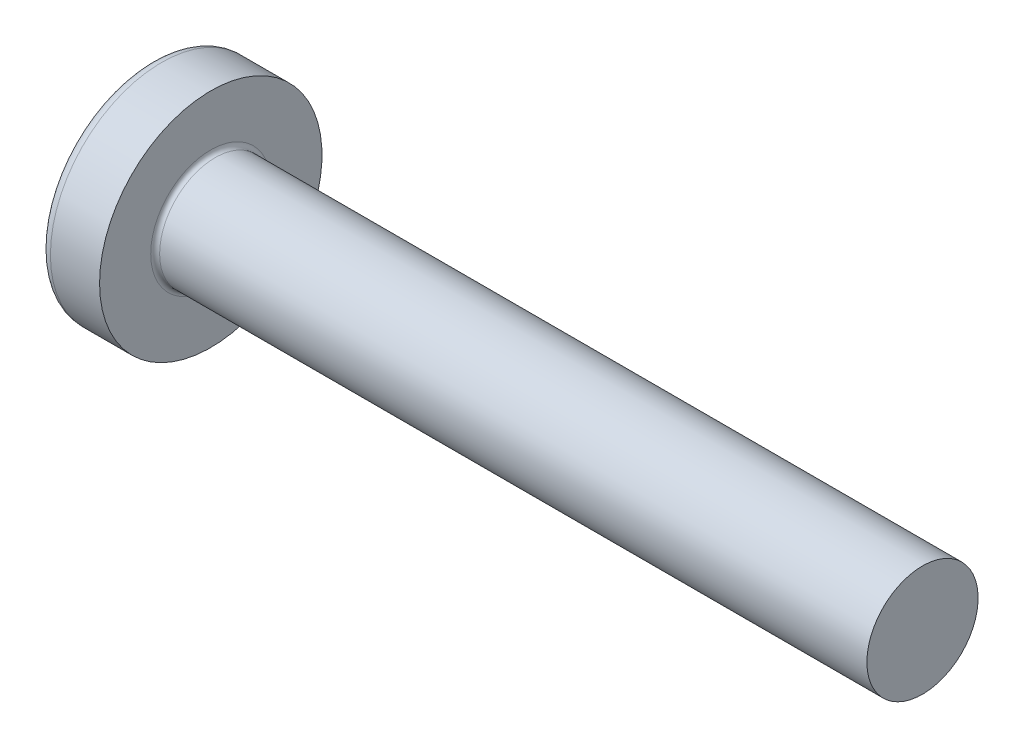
ISO-10303-21;
HEADER;
FILE_DESCRIPTION(('STEP AP214'),'2;1');
FILE_NAME('part.step','',(''),(''),'','','');
FILE_SCHEMA(('AUTOMOTIVE_DESIGN { 1 0 10303 214 1 1 1 1 }'));
ENDSEC;
DATA;
#1=APPLICATION_CONTEXT('core data for automotive mechanical design processes');
#2=APPLICATION_PROTOCOL_DEFINITION('international standard','automotive_design',2000,#1);
#3=PRODUCT_CONTEXT('',#1,'mechanical');
#4=PRODUCT('Part','Part','',(#3));
#5=PRODUCT_RELATED_PRODUCT_CATEGORY('part','',(#4));
#6=PRODUCT_DEFINITION_FORMATION('','',#4);
#7=PRODUCT_DEFINITION_CONTEXT('part definition',#1,'design');
#8=PRODUCT_DEFINITION('design','',#6,#7);
#9=PRODUCT_DEFINITION_SHAPE('','',#8);
#10=(LENGTH_UNIT() NAMED_UNIT(*) SI_UNIT(.MILLI.,.METRE.));
#11=(NAMED_UNIT(*) PLANE_ANGLE_UNIT() SI_UNIT($,.RADIAN.));
#12=(NAMED_UNIT(*) SI_UNIT($,.STERADIAN.) SOLID_ANGLE_UNIT());
#13=UNCERTAINTY_MEASURE_WITH_UNIT(LENGTH_MEASURE(1.E-05),#10,'distance_accuracy_value','');
#14=(GEOMETRIC_REPRESENTATION_CONTEXT(3) GLOBAL_UNCERTAINTY_ASSIGNED_CONTEXT((#13)) GLOBAL_UNIT_ASSIGNED_CONTEXT((#10,
#11,#12)) REPRESENTATION_CONTEXT('',''));
#15=CARTESIAN_POINT('',(0.,0.,0.));
#16=DIRECTION('',(0.,0.,1.));
#17=DIRECTION('',(1.,0.,0.));
#18=AXIS2_PLACEMENT_3D('',#15,#16,#17);
#19=CARTESIAN_POINT('',(4.,0.,0.));
#20=DIRECTION('',(-1.,0.,0.));
#21=DIRECTION('',(0.,1.,0.));
#22=AXIS2_PLACEMENT_3D('',#19,#20,#21);
#23=SPHERICAL_SURFACE('',#22,4.);
#24=CARTESIAN_POINT('',(0.803195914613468,0.,0.));
#25=DIRECTION('',(-1.,0.,0.));
#26=DIRECTION('',(0.,0.,1.));
#27=AXIS2_PLACEMENT_3D('',#24,#25,#26);
#28=CIRCLE('',#27,2.40425531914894);
#29=CARTESIAN_POINT('',(0.803195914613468,0.,2.40425531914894));
#30=VERTEX_POINT('',#29);
#31=EDGE_CURVE('E240',#30,#30,#28,.T.);
#32=ORIENTED_EDGE('',*,*,#31,.T.);
#33=EDGE_LOOP('',(#32));
#34=FACE_BOUND('',#33,.T.);
#35=CARTESIAN_POINT('',(0.0543400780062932,0.,0.));
#36=DIRECTION('',(1.,0.,0.));
#37=DIRECTION('',(0.,0.,-1.));
#38=AXIS2_PLACEMENT_3D('',#35,#36,#37);
#39=CIRCLE('',#38,0.657090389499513);
#40=CARTESIAN_POINT('',(0.0543400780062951,-0.369999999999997,-0.543017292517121));
#41=VERTEX_POINT('',#40);
#42=CARTESIAN_POINT('',(0.0543400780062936,-0.543017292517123,-0.37));
#43=VERTEX_POINT('',#42);
#44=EDGE_CURVE('E376',#41,#43,#39,.F.);
#45=ORIENTED_EDGE('',*,*,#44,.F.);
#46=CARTESIAN_POINT('',(4.,-0.370000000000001,0.));
#47=DIRECTION('',(0.,1.,0.));
#48=DIRECTION('',(0.,0.,1.));
#49=AXIS2_PLACEMENT_3D('',#46,#47,#48);
#50=CIRCLE('',#49,3.98285073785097);
#51=CARTESIAN_POINT('',(0.201999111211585,-0.369999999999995,-1.19928697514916));
#52=VERTEX_POINT('',#51);
#53=EDGE_CURVE('E302',#52,#41,#50,.T.);
#54=ORIENTED_EDGE('',*,*,#53,.F.);
#55=CARTESIAN_POINT('',(3.72274328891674,0.,0.556091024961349));
#56=DIRECTION('',(0.446197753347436,0.,-0.894934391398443));
#57=DIRECTION('',(-0.894934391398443,0.,-0.446197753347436));
#58=AXIS2_PLACEMENT_3D('',#55,#56,#57);
#59=CIRCLE('',#58,3.95144169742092);
#60=CARTESIAN_POINT('',(0.201999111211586,0.370000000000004,-1.19928697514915));
#61=VERTEX_POINT('',#60);
#62=EDGE_CURVE('E274',#52,#61,#59,.T.);
#63=ORIENTED_EDGE('',*,*,#62,.T.);
#64=CARTESIAN_POINT('',(4.,0.369999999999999,0.));
#65=DIRECTION('',(0.,-1.,0.));
#66=DIRECTION('',(0.,0.,-1.));
#67=AXIS2_PLACEMENT_3D('',#64,#65,#66);
#68=CIRCLE('',#67,3.98285073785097);
#69=CARTESIAN_POINT('',(0.0543400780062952,0.370000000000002,-0.543017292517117));
#70=VERTEX_POINT('',#69);
#71=EDGE_CURVE('E329',#70,#61,#68,.T.);
#72=ORIENTED_EDGE('',*,*,#71,.F.);
#73=CARTESIAN_POINT('',(0.0543400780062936,0.543017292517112,-0.37));
#74=VERTEX_POINT('',#73);
#75=EDGE_CURVE('E395',#74,#70,#39,.F.);
#76=ORIENTED_EDGE('',*,*,#75,.F.);
#77=CARTESIAN_POINT('',(4.,0.,-0.369999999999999));
#78=DIRECTION('',(0.,0.,1.));
#79=DIRECTION('',(1.,0.,0.));
#80=AXIS2_PLACEMENT_3D('',#77,#78,#79);
#81=CIRCLE('',#80,3.98285073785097);
#82=CARTESIAN_POINT('',(0.201999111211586,1.19928697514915,-0.37));
#83=VERTEX_POINT('',#82);
#84=EDGE_CURVE('E268',#83,#74,#81,.T.);
#85=ORIENTED_EDGE('',*,*,#84,.F.);
#86=CARTESIAN_POINT('',(3.72274328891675,-0.55609102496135,0.));
#87=DIRECTION('',(0.446197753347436,0.894934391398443,0.));
#88=DIRECTION('',(-0.894934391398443,0.446197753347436,0.));
#89=AXIS2_PLACEMENT_3D('',#86,#87,#88);
#90=CIRCLE('',#89,3.95144169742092);
#91=CARTESIAN_POINT('',(0.201999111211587,1.19928697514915,0.37));
#92=VERTEX_POINT('',#91);
#93=EDGE_CURVE('E271',#83,#92,#90,.T.);
#94=ORIENTED_EDGE('',*,*,#93,.T.);
#95=CARTESIAN_POINT('',(4.,0.,0.370000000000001));
#96=DIRECTION('',(0.,0.,-1.));
#97=DIRECTION('',(-1.,0.,0.));
#98=AXIS2_PLACEMENT_3D('',#95,#96,#97);
#99=CIRCLE('',#98,3.98285073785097);
#100=CARTESIAN_POINT('',(0.0543400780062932,0.543017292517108,0.369999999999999));
#101=VERTEX_POINT('',#100);
#102=EDGE_CURVE('E264',#101,#92,#99,.T.);
#103=ORIENTED_EDGE('',*,*,#102,.F.);
#104=CARTESIAN_POINT('',(0.0543400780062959,0.369999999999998,0.54301729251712));
#105=VERTEX_POINT('',#104);
#106=EDGE_CURVE('E433',#105,#101,#39,.F.);
#107=ORIENTED_EDGE('',*,*,#106,.F.);
#108=CARTESIAN_POINT('',(0.201999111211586,0.369999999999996,1.19928697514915));
#109=VERTEX_POINT('',#108);
#110=EDGE_CURVE('E284',#109,#105,#68,.T.);
#111=ORIENTED_EDGE('',*,*,#110,.F.);
#112=CARTESIAN_POINT('',(3.72274328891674,0.,-0.556091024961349));
#113=DIRECTION('',(0.446197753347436,0.,0.894934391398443));
#114=DIRECTION('',(0.894934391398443,0.,-0.446197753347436));
#115=AXIS2_PLACEMENT_3D('',#112,#113,#114);
#116=CIRCLE('',#115,3.95144169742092);
#117=CARTESIAN_POINT('',(0.201999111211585,-0.370000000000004,1.19928697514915));
#118=VERTEX_POINT('',#117);
#119=EDGE_CURVE('E51',#109,#118,#116,.T.);
#120=ORIENTED_EDGE('',*,*,#119,.T.);
#121=CARTESIAN_POINT('',(0.0543400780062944,-0.370000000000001,0.543017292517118));
#122=VERTEX_POINT('',#121);
#123=EDGE_CURVE('E281',#122,#118,#50,.T.);
#124=ORIENTED_EDGE('',*,*,#123,.F.);
#125=CARTESIAN_POINT('',(0.0543400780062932,-0.543017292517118,0.369999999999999));
#126=VERTEX_POINT('',#125);
#127=EDGE_CURVE('E394',#126,#122,#39,.F.);
#128=ORIENTED_EDGE('',*,*,#127,.F.);
#129=CARTESIAN_POINT('',(0.201999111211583,-1.19928697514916,0.369999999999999));
#130=VERTEX_POINT('',#129);
#131=EDGE_CURVE('E265',#130,#126,#99,.T.);
#132=ORIENTED_EDGE('',*,*,#131,.F.);
#133=CARTESIAN_POINT('',(3.72274328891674,0.556091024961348,0.));
#134=DIRECTION('',(0.446197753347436,-0.894934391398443,0.));
#135=DIRECTION('',(0.894934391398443,0.446197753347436,0.));
#136=AXIS2_PLACEMENT_3D('',#133,#134,#135);
#137=CIRCLE('',#136,3.95144169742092);
#138=CARTESIAN_POINT('',(0.201999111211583,-1.19928697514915,-0.37));
#139=VERTEX_POINT('',#138);
#140=EDGE_CURVE('E261',#130,#139,#137,.T.);
#141=ORIENTED_EDGE('',*,*,#140,.T.);
#142=EDGE_CURVE('E66',#43,#139,#81,.T.);
#143=ORIENTED_EDGE('',*,*,#142,.F.);
#144=EDGE_LOOP('',(#45,#54,#63,#72,#76,#85,#94,#103,#107,#111,#120,#124,#128,#132,#141,#143));
#145=FACE_BOUND('',#144,.T.);
#146=ADVANCED_FACE('F37',(#34,#145),#23,.T.);
#147=CARTESIAN_POINT('',(1.5,0.552127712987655,-0.37));
#148=DIRECTION('',(0.,0.,1.));
#149=DIRECTION('',(1.,0.,0.));
#150=AXIS2_PLACEMENT_3D('',#147,#148,#149);
#151=PLANE('',#150);
#152=ORIENTED_EDGE('',*,*,#84,.T.);
#153=CARTESIAN_POINT('',(-0.984107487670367,0.628943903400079,-0.37));
#154=CARTESIAN_POINT('',(-0.783603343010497,0.61266994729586,-0.37));
#155=CARTESIAN_POINT('',(-0.583110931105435,0.596248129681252,-0.37));
#156=CARTESIAN_POINT('',(-0.182155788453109,0.562989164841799,-0.37));
#157=CARTESIAN_POINT('',(0.0183069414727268,0.546152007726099,-0.37));
#158=CARTESIAN_POINT('',(0.419186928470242,0.511943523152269,-0.37));
#159=CARTESIAN_POINT('',(0.619604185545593,0.494572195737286,-0.37));
#160=CARTESIAN_POINT('',(1.02037173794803,0.459102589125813,-0.37));
#161=CARTESIAN_POINT('',(1.2207220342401,0.441004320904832,-0.37));
#162=CARTESIAN_POINT('',(1.53631168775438,0.411665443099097,-0.37));
#163=CARTESIAN_POINT('',(1.65158348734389,0.400774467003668,-0.37));
#164=CARTESIAN_POINT('',(1.88208360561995,0.378547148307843,-0.37));
#165=CARTESIAN_POINT('',(1.99731192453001,0.367210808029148,-0.37));
#166=CARTESIAN_POINT('',(2.22771614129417,0.343963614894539,-0.37));
#167=CARTESIAN_POINT('',(2.34289203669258,0.332052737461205,-0.37));
#168=CARTESIAN_POINT('',(2.57315819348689,0.307413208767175,-0.37));
#169=CARTESIAN_POINT('',(2.68824845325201,0.294684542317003,-0.37));
#170=CARTESIAN_POINT('',(2.80327961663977,0.281425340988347,-0.37));
#171=B_SPLINE_CURVE_WITH_KNOTS('',3,(#153,#154,#155,#156,#157,#158,#159,#160,#161,#162,#163,
#164,#165,#166,#167,#168,#169,#170),.UNSPECIFIED.,.F.,.F.,(4,2,2,2,2,2,2,2,4),(0.,
0.603490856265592,1.20699609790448,1.81050129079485,2.41399737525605,2.76135214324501,
3.1087051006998,3.45607293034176,3.80344721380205),.UNSPECIFIED.);
#172=CARTESIAN_POINT('',(1.5,0.415013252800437,-0.370000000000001));
#173=VERTEX_POINT('',#172);
#174=EDGE_CURVE('E418',#74,#173,#171,.T.);
#175=ORIENTED_EDGE('',*,*,#174,.T.);
#176=DIRECTION('',(0.,1.,0.));
#177=VECTOR('',#176,1.);
#178=CARTESIAN_POINT('',(1.5,-0.552127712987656,-0.37));
#179=LINE('',#178,#177);
#180=CARTESIAN_POINT('',(1.5,0.552127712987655,-0.37));
#181=VERTEX_POINT('',#180);
#182=EDGE_CURVE('E358',#173,#181,#179,.T.);
#183=ORIENTED_EDGE('',*,*,#182,.T.);
#184=DIRECTION('',(0.894934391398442,-0.446197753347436,0.));
#185=VECTOR('',#184,1.);
#186=CARTESIAN_POINT('',(0.,1.3,-0.37));
#187=LINE('',#186,#185);
#188=EDGE_CURVE('E241',#83,#181,#187,.T.);
#189=ORIENTED_EDGE('',*,*,#188,.F.);
#190=EDGE_LOOP('',(#152,#175,#183,#189));
#191=FACE_BOUND('',#190,.T.);
#192=ADVANCED_FACE('F196',(#191),#151,.T.);
#193=CARTESIAN_POINT('',(1.5,-0.552127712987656,-0.37));
#194=VERTEX_POINT('',#193);
#195=CARTESIAN_POINT('',(1.5,-0.415013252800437,-0.370000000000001));
#196=VERTEX_POINT('',#195);
#197=EDGE_CURVE('E249',#194,#196,#179,.T.);
#198=ORIENTED_EDGE('',*,*,#197,.T.);
#199=CARTESIAN_POINT('',(-0.984107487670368,-0.628943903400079,-0.37));
#200=CARTESIAN_POINT('',(-0.783603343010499,-0.61266994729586,-0.37));
#201=CARTESIAN_POINT('',(-0.583110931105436,-0.596248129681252,-0.37));
#202=CARTESIAN_POINT('',(-0.18215578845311,-0.562989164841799,-0.37));
#203=CARTESIAN_POINT('',(0.0183069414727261,-0.546152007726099,-0.37));
#204=CARTESIAN_POINT('',(0.419186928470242,-0.511943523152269,-0.37));
#205=CARTESIAN_POINT('',(0.619604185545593,-0.494572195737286,-0.37));
#206=CARTESIAN_POINT('',(1.02037173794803,-0.459102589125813,-0.37));
#207=CARTESIAN_POINT('',(1.22072203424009,-0.441004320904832,-0.37));
#208=CARTESIAN_POINT('',(1.53631168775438,-0.411665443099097,-0.37));
#209=CARTESIAN_POINT('',(1.65158348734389,-0.400774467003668,-0.37));
#210=CARTESIAN_POINT('',(1.88208360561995,-0.378547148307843,-0.37));
#211=CARTESIAN_POINT('',(1.99731192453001,-0.367210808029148,-0.37));
#212=CARTESIAN_POINT('',(2.22771614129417,-0.343963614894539,-0.37));
#213=CARTESIAN_POINT('',(2.34289203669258,-0.332052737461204,-0.37));
#214=CARTESIAN_POINT('',(2.57315819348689,-0.307413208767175,-0.37));
#215=CARTESIAN_POINT('',(2.68824845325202,-0.294684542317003,-0.37));
#216=CARTESIAN_POINT('',(2.80327961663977,-0.281425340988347,-0.37));
#217=B_SPLINE_CURVE_WITH_KNOTS('',3,(#199,#200,#201,#202,#203,#204,#205,#206,#207,#208,#209,
#210,#211,#212,#213,#214,#215,#216),.UNSPECIFIED.,.F.,.F.,(4,2,2,2,2,2,2,2,4),(0.,
0.603490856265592,1.20699609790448,1.81050129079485,2.41399737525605,2.76135214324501,
3.1087051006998,3.45607293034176,3.80344721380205),.UNSPECIFIED.);
#218=EDGE_CURVE('E393',#196,#43,#217,.F.);
#219=ORIENTED_EDGE('',*,*,#218,.T.);
#220=ORIENTED_EDGE('',*,*,#142,.T.);
#221=DIRECTION('',(0.894934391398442,0.446197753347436,0.));
#222=VECTOR('',#221,1.);
#223=CARTESIAN_POINT('',(0.,-1.3,-0.37));
#224=LINE('',#223,#222);
#225=EDGE_CURVE('E332',#139,#194,#224,.T.);
#226=ORIENTED_EDGE('',*,*,#225,.T.);
#227=EDGE_LOOP('',(#198,#219,#220,#226));
#228=FACE_BOUND('',#227,.T.);
#229=ADVANCED_FACE('F202',(#228),#151,.T.);
#230=CARTESIAN_POINT('',(1.5,-0.552127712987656,0.37));
#231=DIRECTION('',(0.,0.,-1.));
#232=DIRECTION('',(-1.,0.,0.));
#233=AXIS2_PLACEMENT_3D('',#230,#231,#232);
#234=PLANE('',#233);
#235=DIRECTION('',(0.,-1.,0.));
#236=VECTOR('',#235,1.);
#237=CARTESIAN_POINT('',(1.5,0.552127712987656,0.37));
#238=LINE('',#237,#236);
#239=CARTESIAN_POINT('',(1.5,0.552127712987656,0.37));
#240=VERTEX_POINT('',#239);
#241=CARTESIAN_POINT('',(1.5,0.415013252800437,0.370000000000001));
#242=VERTEX_POINT('',#241);
#243=EDGE_CURVE('E341',#240,#242,#238,.T.);
#244=ORIENTED_EDGE('',*,*,#243,.T.);
#245=CARTESIAN_POINT('',(-0.984107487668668,0.628943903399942,0.369999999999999));
#246=CARTESIAN_POINT('',(-0.783603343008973,0.612669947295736,0.369999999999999));
#247=CARTESIAN_POINT('',(-0.583110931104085,0.596248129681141,0.369999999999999));
#248=CARTESIAN_POINT('',(-0.182155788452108,0.562989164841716,0.369999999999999));
#249=CARTESIAN_POINT('',(0.018306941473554,0.54615200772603,0.369999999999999));
#250=CARTESIAN_POINT('',(0.419186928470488,0.511943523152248,0.369999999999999));
#251=CARTESIAN_POINT('',(0.619604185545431,0.4945721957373,0.369999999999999));
#252=CARTESIAN_POINT('',(1.02037173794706,0.459102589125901,0.37));
#253=CARTESIAN_POINT('',(1.22072203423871,0.441004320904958,0.37));
#254=CARTESIAN_POINT('',(1.53631168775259,0.411665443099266,0.37));
#255=CARTESIAN_POINT('',(1.65158348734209,0.400774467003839,0.37));
#256=CARTESIAN_POINT('',(1.88208360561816,0.378547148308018,0.37));
#257=CARTESIAN_POINT('',(1.99731192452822,0.367210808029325,0.37));
#258=CARTESIAN_POINT('',(2.22771614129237,0.343963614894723,0.37));
#259=CARTESIAN_POINT('',(2.34289203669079,0.332052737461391,0.37));
#260=CARTESIAN_POINT('',(2.5731581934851,0.30741320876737,0.370000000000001));
#261=CARTESIAN_POINT('',(2.68824845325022,0.294684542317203,0.370000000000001));
#262=CARTESIAN_POINT('',(2.80327961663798,0.281425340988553,0.370000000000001));
#263=B_SPLINE_CURVE_WITH_KNOTS('',3,(#245,#246,#247,#248,#249,#250,#251,#252,#253,#254,#255,
#256,#257,#258,#259,#260,#261,#262),.UNSPECIFIED.,.F.,.F.,(4,2,2,2,2,2,2,2,4),(0.,
0.603490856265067,1.20699609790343,1.81050129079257,2.41399737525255,2.7613521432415,
3.1087051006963,3.45607293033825,3.80344721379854),.UNSPECIFIED.);
#264=EDGE_CURVE('E434',#242,#101,#263,.F.);
#265=ORIENTED_EDGE('',*,*,#264,.T.);
#266=ORIENTED_EDGE('',*,*,#102,.T.);
#267=DIRECTION('',(0.894934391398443,-0.446197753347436,0.));
#268=VECTOR('',#267,1.);
#269=CARTESIAN_POINT('',(0.,1.3,0.37));
#270=LINE('',#269,#268);
#271=EDGE_CURVE('E246',#92,#240,#270,.T.);
#272=ORIENTED_EDGE('',*,*,#271,.T.);
#273=EDGE_LOOP('',(#244,#265,#266,#272));
#274=FACE_BOUND('',#273,.T.);
#275=ADVANCED_FACE('F414',(#274),#234,.T.);
#276=ORIENTED_EDGE('',*,*,#131,.T.);
#277=CARTESIAN_POINT('',(-0.984107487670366,-0.62894390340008,0.369999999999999));
#278=CARTESIAN_POINT('',(-0.783603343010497,-0.612669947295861,0.369999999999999));
#279=CARTESIAN_POINT('',(-0.583110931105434,-0.596248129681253,0.369999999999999));
#280=CARTESIAN_POINT('',(-0.182155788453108,-0.5629891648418,0.369999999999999));
#281=CARTESIAN_POINT('',(0.0183069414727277,-0.5461520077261,0.369999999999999));
#282=CARTESIAN_POINT('',(0.419186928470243,-0.511943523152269,0.369999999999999));
#283=CARTESIAN_POINT('',(0.619604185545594,-0.494572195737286,0.369999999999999));
#284=CARTESIAN_POINT('',(1.02037173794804,-0.459102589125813,0.37));
#285=CARTESIAN_POINT('',(1.2207220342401,-0.441004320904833,0.37));
#286=CARTESIAN_POINT('',(1.53631168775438,-0.411665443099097,0.37));
#287=CARTESIAN_POINT('',(1.65158348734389,-0.400774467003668,0.37));
#288=CARTESIAN_POINT('',(1.88208360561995,-0.378547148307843,0.37));
#289=CARTESIAN_POINT('',(1.99731192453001,-0.367210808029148,0.37));
#290=CARTESIAN_POINT('',(2.22771614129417,-0.343963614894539,0.37));
#291=CARTESIAN_POINT('',(2.34289203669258,-0.332052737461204,0.37));
#292=CARTESIAN_POINT('',(2.57315819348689,-0.307413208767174,0.37));
#293=CARTESIAN_POINT('',(2.68824845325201,-0.294684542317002,0.370000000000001));
#294=CARTESIAN_POINT('',(2.80327961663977,-0.281425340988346,0.370000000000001));
#295=B_SPLINE_CURVE_WITH_KNOTS('',3,(#277,#278,#279,#280,#281,#282,#283,#284,#285,#286,#287,
#288,#289,#290,#291,#292,#293,#294),.UNSPECIFIED.,.F.,.F.,(4,2,2,2,2,2,2,2,4),(0.,
0.603490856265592,1.20699609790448,1.81050129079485,2.41399737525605,2.76135214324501,
3.1087051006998,3.45607293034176,3.80344721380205),.UNSPECIFIED.);
#296=CARTESIAN_POINT('',(1.5,-0.415013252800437,0.370000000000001));
#297=VERTEX_POINT('',#296);
#298=EDGE_CURVE('E455',#126,#297,#295,.T.);
#299=ORIENTED_EDGE('',*,*,#298,.T.);
#300=CARTESIAN_POINT('',(1.5,-0.552127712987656,0.37));
#301=VERTEX_POINT('',#300);
#302=EDGE_CURVE('E343',#297,#301,#238,.T.);
#303=ORIENTED_EDGE('',*,*,#302,.T.);
#304=DIRECTION('',(0.894934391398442,0.446197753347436,0.));
#305=VECTOR('',#304,1.);
#306=CARTESIAN_POINT('',(0.,-1.3,0.369999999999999));
#307=LINE('',#306,#305);
#308=EDGE_CURVE('E334',#130,#301,#307,.T.);
#309=ORIENTED_EDGE('',*,*,#308,.F.);
#310=EDGE_LOOP('',(#276,#299,#303,#309));
#311=FACE_BOUND('',#310,.T.);
#312=ADVANCED_FACE('F517',(#311),#234,.T.);
#313=CARTESIAN_POINT('',(1.5,0.552127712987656,0.37));
#314=DIRECTION('',(0.446197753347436,0.894934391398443,0.));
#315=DIRECTION('',(-0.894934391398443,0.446197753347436,0.));
#316=AXIS2_PLACEMENT_3D('',#313,#314,#315);
#317=PLANE('',#316);
#318=CARTESIAN_POINT('',(2.47007552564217,0.068465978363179,0.));
#319=DIRECTION('',(0.446197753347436,0.894934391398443,0.));
#320=DIRECTION('',(-0.894934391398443,0.446197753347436,0.));
#321=AXIS2_PLACEMENT_3D('',#318,#319,#320);
#322=ELLIPSE('',#321,1.0940568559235,0.483340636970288);
#323=CARTESIAN_POINT('',(1.5,0.552127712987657,0.065505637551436));
#324=VERTEX_POINT('',#323);
#325=CARTESIAN_POINT('',(1.5,0.552127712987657,-0.0655056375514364));
#326=VERTEX_POINT('',#325);
#327=EDGE_CURVE('E307',#324,#326,#322,.F.);
#328=ORIENTED_EDGE('',*,*,#327,.F.);
#329=DIRECTION('',(0.,0.,-1.));
#330=VECTOR('',#329,1.);
#331=CARTESIAN_POINT('',(1.5,0.552127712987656,0.37));
#332=LINE('',#331,#330);
#333=EDGE_CURVE('E344',#240,#324,#332,.T.);
#334=ORIENTED_EDGE('',*,*,#333,.F.);
#335=ORIENTED_EDGE('',*,*,#271,.F.);
#336=ORIENTED_EDGE('',*,*,#93,.F.);
#337=ORIENTED_EDGE('',*,*,#188,.T.);
#338=EDGE_CURVE('E346',#326,#181,#332,.T.);
#339=ORIENTED_EDGE('',*,*,#338,.F.);
#340=EDGE_LOOP('',(#328,#334,#335,#336,#337,#339));
#341=FACE_BOUND('',#340,.T.);
#342=ADVANCED_FACE('F412',(#341),#317,.F.);
#343=CARTESIAN_POINT('',(1.5,-0.552127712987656,-0.37));
#344=DIRECTION('',(0.446197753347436,-0.894934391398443,0.));
#345=DIRECTION('',(0.894934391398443,0.446197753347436,0.));
#346=AXIS2_PLACEMENT_3D('',#343,#344,#345);
#347=PLANE('',#346);
#348=CARTESIAN_POINT('',(2.47007552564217,-0.0684659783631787,0.));
#349=DIRECTION('',(0.446197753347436,-0.894934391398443,0.));
#350=DIRECTION('',(-0.894934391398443,-0.446197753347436,0.));
#351=AXIS2_PLACEMENT_3D('',#348,#349,#350);
#352=ELLIPSE('',#351,1.0940568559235,0.483340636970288);
#353=CARTESIAN_POINT('',(1.5,-0.552127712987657,-0.0655056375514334));
#354=VERTEX_POINT('',#353);
#355=CARTESIAN_POINT('',(1.5,-0.552127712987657,0.0655056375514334));
#356=VERTEX_POINT('',#355);
#357=EDGE_CURVE('E461',#354,#356,#352,.F.);
#358=ORIENTED_EDGE('',*,*,#357,.F.);
#359=DIRECTION('',(0.,0.,1.));
#360=VECTOR('',#359,1.);
#361=CARTESIAN_POINT('',(1.5,-0.552127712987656,-0.37));
#362=LINE('',#361,#360);
#363=EDGE_CURVE('E337',#194,#354,#362,.T.);
#364=ORIENTED_EDGE('',*,*,#363,.F.);
#365=ORIENTED_EDGE('',*,*,#225,.F.);
#366=ORIENTED_EDGE('',*,*,#140,.F.);
#367=ORIENTED_EDGE('',*,*,#308,.T.);
#368=EDGE_CURVE('E340',#356,#301,#362,.T.);
#369=ORIENTED_EDGE('',*,*,#368,.F.);
#370=EDGE_LOOP('',(#358,#364,#365,#366,#367,#369));
#371=FACE_BOUND('',#370,.T.);
#372=ADVANCED_FACE('F509',(#371),#347,.F.);
#373=CARTESIAN_POINT('',(1.5,-0.552127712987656,-0.37));
#374=DIRECTION('',(1.,0.,0.));
#375=DIRECTION('',(0.,0.,-1.));
#376=AXIS2_PLACEMENT_3D('',#373,#374,#375);
#377=PLANE('',#376);
#378=CARTESIAN_POINT('',(1.5,0.,0.));
#379=DIRECTION('',(-1.,0.,0.));
#380=DIRECTION('',(0.,0.,1.));
#381=AXIS2_PLACEMENT_3D('',#378,#379,#380);
#382=CIRCLE('',#381,0.556);
#383=CARTESIAN_POINT('',(1.5,-0.065505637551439,-0.552127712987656));
#384=VERTEX_POINT('',#383);
#385=CARTESIAN_POINT('',(1.5,-0.369999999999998,-0.415013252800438));
#386=VERTEX_POINT('',#385);
#387=EDGE_CURVE('E58',#384,#386,#382,.T.);
#388=ORIENTED_EDGE('',*,*,#387,.F.);
#389=DIRECTION('',(0.,-1.,0.));
#390=VECTOR('',#389,1.);
#391=CARTESIAN_POINT('',(1.5,0.370000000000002,-0.552127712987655));
#392=LINE('',#391,#390);
#393=CARTESIAN_POINT('',(1.5,-0.369999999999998,-0.552127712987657));
#394=VERTEX_POINT('',#393);
#395=EDGE_CURVE('E317',#384,#394,#392,.T.);
#396=ORIENTED_EDGE('',*,*,#395,.T.);
#397=DIRECTION('',(0.,0.,-1.));
#398=VECTOR('',#397,1.);
#399=CARTESIAN_POINT('',(1.5,-0.370000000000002,0.552127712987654));
#400=LINE('',#399,#398);
#401=EDGE_CURVE('E321',#386,#394,#400,.T.);
#402=ORIENTED_EDGE('',*,*,#401,.F.);
#403=EDGE_LOOP('',(#388,#396,#402));
#404=FACE_BOUND('',#403,.T.);
#405=ADVANCED_FACE('F382',(#404),#377,.F.);
#406=EDGE_CURVE('E387',#196,#354,#382,.T.);
#407=ORIENTED_EDGE('',*,*,#406,.F.);
#408=ORIENTED_EDGE('',*,*,#197,.F.);
#409=ORIENTED_EDGE('',*,*,#363,.T.);
#410=EDGE_LOOP('',(#407,#408,#409));
#411=FACE_BOUND('',#410,.T.);
#412=ADVANCED_FACE('F516',(#411),#377,.F.);
#413=EDGE_CURVE('E524',#356,#297,#382,.T.);
#414=ORIENTED_EDGE('',*,*,#413,.F.);
#415=ORIENTED_EDGE('',*,*,#368,.T.);
#416=ORIENTED_EDGE('',*,*,#302,.F.);
#417=EDGE_LOOP('',(#414,#415,#416));
#418=FACE_BOUND('',#417,.T.);
#419=ADVANCED_FACE('F505',(#418),#377,.F.);
#420=CARTESIAN_POINT('',(1.5,-0.370000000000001,0.415013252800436));
#421=VERTEX_POINT('',#420);
#422=CARTESIAN_POINT('',(1.5,-0.0655056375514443,0.552127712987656));
#423=VERTEX_POINT('',#422);
#424=EDGE_CURVE('E492',#421,#423,#382,.T.);
#425=ORIENTED_EDGE('',*,*,#424,.F.);
#426=CARTESIAN_POINT('',(1.5,-0.370000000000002,0.552127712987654));
#427=VERTEX_POINT('',#426);
#428=EDGE_CURVE('E318',#427,#421,#400,.T.);
#429=ORIENTED_EDGE('',*,*,#428,.F.);
#430=DIRECTION('',(0.,1.,0.));
#431=VECTOR('',#430,1.);
#432=CARTESIAN_POINT('',(1.5,-0.370000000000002,0.552127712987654));
#433=LINE('',#432,#431);
#434=EDGE_CURVE('E322',#427,#423,#433,.T.);
#435=ORIENTED_EDGE('',*,*,#434,.T.);
#436=EDGE_LOOP('',(#425,#429,#435));
#437=FACE_BOUND('',#436,.T.);
#438=ADVANCED_FACE('F490',(#437),#377,.F.);
#439=CARTESIAN_POINT('',(1.5,0.0655056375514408,0.552127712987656));
#440=VERTEX_POINT('',#439);
#441=CARTESIAN_POINT('',(1.5,0.369999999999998,0.415013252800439));
#442=VERTEX_POINT('',#441);
#443=EDGE_CURVE('E388',#440,#442,#382,.T.);
#444=ORIENTED_EDGE('',*,*,#443,.F.);
#445=CARTESIAN_POINT('',(1.5,0.369999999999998,0.552127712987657));
#446=VERTEX_POINT('',#445);
#447=EDGE_CURVE('E325',#440,#446,#433,.T.);
#448=ORIENTED_EDGE('',*,*,#447,.T.);
#449=DIRECTION('',(0.,0.,1.));
#450=VECTOR('',#449,1.);
#451=CARTESIAN_POINT('',(1.5,0.370000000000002,-0.552127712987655));
#452=LINE('',#451,#450);
#453=EDGE_CURVE('E299',#442,#446,#452,.T.);
#454=ORIENTED_EDGE('',*,*,#453,.F.);
#455=EDGE_LOOP('',(#444,#448,#454));
#456=FACE_BOUND('',#455,.T.);
#457=ADVANCED_FACE('F498',(#456),#377,.F.);
#458=EDGE_CURVE('E475',#242,#324,#382,.T.);
#459=ORIENTED_EDGE('',*,*,#458,.F.);
#460=ORIENTED_EDGE('',*,*,#243,.F.);
#461=ORIENTED_EDGE('',*,*,#333,.T.);
#462=EDGE_LOOP('',(#459,#460,#461));
#463=FACE_BOUND('',#462,.T.);
#464=ADVANCED_FACE('F500',(#463),#377,.F.);
#465=EDGE_CURVE('E473',#326,#173,#382,.T.);
#466=ORIENTED_EDGE('',*,*,#465,.F.);
#467=ORIENTED_EDGE('',*,*,#338,.T.);
#468=ORIENTED_EDGE('',*,*,#182,.F.);
#469=EDGE_LOOP('',(#466,#467,#468));
#470=FACE_BOUND('',#469,.T.);
#471=ADVANCED_FACE('F445',(#470),#377,.F.);
#472=CARTESIAN_POINT('',(1.5,-0.369999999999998,-0.552127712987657));
#473=DIRECTION('',(0.,1.,0.));
#474=DIRECTION('',(-1.,0.,0.));
#475=AXIS2_PLACEMENT_3D('',#472,#473,#474);
#476=PLANE('',#475);
#477=ORIENTED_EDGE('',*,*,#428,.T.);
#478=CARTESIAN_POINT('',(-0.984107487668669,-0.370000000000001,0.628943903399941));
#479=CARTESIAN_POINT('',(-0.783603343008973,-0.370000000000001,0.612669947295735));
#480=CARTESIAN_POINT('',(-0.583110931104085,-0.370000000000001,0.59624812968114));
#481=CARTESIAN_POINT('',(-0.182155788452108,-0.370000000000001,0.562989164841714));
#482=CARTESIAN_POINT('',(0.0183069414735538,-0.370000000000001,0.546152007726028));
#483=CARTESIAN_POINT('',(0.419186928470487,-0.370000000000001,0.511943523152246));
#484=CARTESIAN_POINT('',(0.619604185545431,-0.370000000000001,0.494572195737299));
#485=CARTESIAN_POINT('',(1.02037173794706,-0.370000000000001,0.459102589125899));
#486=CARTESIAN_POINT('',(1.22072203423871,-0.370000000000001,0.441004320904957));
#487=CARTESIAN_POINT('',(1.53631168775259,-0.370000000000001,0.411665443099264));
#488=CARTESIAN_POINT('',(1.65158348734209,-0.370000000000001,0.400774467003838));
#489=CARTESIAN_POINT('',(1.88208360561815,-0.370000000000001,0.378547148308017));
#490=CARTESIAN_POINT('',(1.99731192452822,-0.370000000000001,0.367210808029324));
#491=CARTESIAN_POINT('',(2.22771614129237,-0.370000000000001,0.343963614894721));
#492=CARTESIAN_POINT('',(2.34289203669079,-0.370000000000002,0.33205273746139));
#493=CARTESIAN_POINT('',(2.5731581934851,-0.370000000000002,0.307413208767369));
#494=CARTESIAN_POINT('',(2.68824845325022,-0.370000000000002,0.294684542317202));
#495=CARTESIAN_POINT('',(2.80327961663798,-0.370000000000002,0.281425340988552));
#496=B_SPLINE_CURVE_WITH_KNOTS('',3,(#478,#479,#480,#481,#482,#483,#484,#485,#486,#487,#488,
#489,#490,#491,#492,#493,#494,#495),.UNSPECIFIED.,.F.,.F.,(4,2,2,2,2,2,2,2,4),(0.,
0.603490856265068,1.20699609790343,1.81050129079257,2.41399737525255,2.7613521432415,
3.1087051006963,3.45607293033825,3.80344721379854),.UNSPECIFIED.);
#497=EDGE_CURVE('E448',#421,#122,#496,.F.);
#498=ORIENTED_EDGE('',*,*,#497,.T.);
#499=ORIENTED_EDGE('',*,*,#123,.T.);
#500=DIRECTION('',(0.894934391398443,0.,-0.446197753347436));
#501=VECTOR('',#500,1.);
#502=CARTESIAN_POINT('',(0.,-0.370000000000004,1.3));
#503=LINE('',#502,#501);
#504=EDGE_CURVE('E294',#118,#427,#503,.T.);
#505=ORIENTED_EDGE('',*,*,#504,.T.);
#506=EDGE_LOOP('',(#477,#498,#499,#505));
#507=FACE_BOUND('',#506,.T.);
#508=ADVANCED_FACE('F231',(#507),#476,.T.);
#509=CARTESIAN_POINT('',(1.5,0.369999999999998,0.552127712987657));
#510=DIRECTION('',(0.,-1.,0.));
#511=DIRECTION('',(1.,0.,0.));
#512=AXIS2_PLACEMENT_3D('',#509,#510,#511);
#513=PLANE('',#512);
#514=ORIENTED_EDGE('',*,*,#110,.T.);
#515=CARTESIAN_POINT('',(-0.984107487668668,0.369999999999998,0.628943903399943));
#516=CARTESIAN_POINT('',(-0.783603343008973,0.369999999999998,0.612669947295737));
#517=CARTESIAN_POINT('',(-0.583110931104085,0.369999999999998,0.596248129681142));
#518=CARTESIAN_POINT('',(-0.182155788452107,0.369999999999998,0.562989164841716));
#519=CARTESIAN_POINT('',(0.0183069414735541,0.369999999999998,0.54615200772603));
#520=CARTESIAN_POINT('',(0.419186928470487,0.369999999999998,0.511943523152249));
#521=CARTESIAN_POINT('',(0.61960418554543,0.369999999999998,0.494572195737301));
#522=CARTESIAN_POINT('',(1.02037173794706,0.369999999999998,0.459102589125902));
#523=CARTESIAN_POINT('',(1.22072203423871,0.369999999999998,0.441004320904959));
#524=CARTESIAN_POINT('',(1.53631168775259,0.369999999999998,0.411665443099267));
#525=CARTESIAN_POINT('',(1.65158348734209,0.369999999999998,0.40077446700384));
#526=CARTESIAN_POINT('',(1.88208360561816,0.369999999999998,0.37854714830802));
#527=CARTESIAN_POINT('',(1.99731192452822,0.369999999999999,0.367210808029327));
#528=CARTESIAN_POINT('',(2.22771614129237,0.369999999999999,0.343963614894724));
#529=CARTESIAN_POINT('',(2.34289203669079,0.369999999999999,0.332052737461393));
#530=CARTESIAN_POINT('',(2.5731581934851,0.369999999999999,0.307413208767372));
#531=CARTESIAN_POINT('',(2.68824845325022,0.369999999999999,0.294684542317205));
#532=CARTESIAN_POINT('',(2.80327961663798,0.369999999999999,0.281425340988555));
#533=B_SPLINE_CURVE_WITH_KNOTS('',3,(#515,#516,#517,#518,#519,#520,#521,#522,#523,#524,#525,
#526,#527,#528,#529,#530,#531,#532),.UNSPECIFIED.,.F.,.F.,(4,2,2,2,2,2,2,2,4),(0.,
0.603490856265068,1.20699609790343,1.81050129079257,2.41399737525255,2.7613521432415,
3.1087051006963,3.45607293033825,3.80344721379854),.UNSPECIFIED.);
#534=EDGE_CURVE('E427',#105,#442,#533,.T.);
#535=ORIENTED_EDGE('',*,*,#534,.T.);
#536=ORIENTED_EDGE('',*,*,#453,.T.);
#537=DIRECTION('',(0.894934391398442,0.,-0.446197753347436));
#538=VECTOR('',#537,1.);
#539=CARTESIAN_POINT('',(0.,0.369999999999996,1.3));
#540=LINE('',#539,#538);
#541=EDGE_CURVE('E292',#109,#446,#540,.T.);
#542=ORIENTED_EDGE('',*,*,#541,.F.);
#543=EDGE_LOOP('',(#514,#535,#536,#542));
#544=FACE_BOUND('',#543,.T.);
#545=ADVANCED_FACE('F296',(#544),#513,.T.);
#546=CARTESIAN_POINT('',(1.5,-0.370000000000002,0.552127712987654));
#547=DIRECTION('',(0.446197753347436,0.,0.894934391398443));
#548=DIRECTION('',(-0.894934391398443,0.,0.446197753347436));
#549=AXIS2_PLACEMENT_3D('',#546,#547,#548);
#550=PLANE('',#549);
#551=CARTESIAN_POINT('',(2.47007552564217,0.,0.068465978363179));
#552=DIRECTION('',(0.446197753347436,0.,0.894934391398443));
#553=DIRECTION('',(-0.894934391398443,0.,0.446197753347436));
#554=AXIS2_PLACEMENT_3D('',#551,#552,#553);
#555=ELLIPSE('',#554,1.0940568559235,0.483340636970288);
#556=EDGE_CURVE('E425',#423,#440,#555,.F.);
#557=ORIENTED_EDGE('',*,*,#556,.F.);
#558=ORIENTED_EDGE('',*,*,#434,.F.);
#559=ORIENTED_EDGE('',*,*,#504,.F.);
#560=ORIENTED_EDGE('',*,*,#119,.F.);
#561=ORIENTED_EDGE('',*,*,#541,.T.);
#562=ORIENTED_EDGE('',*,*,#447,.F.);
#563=EDGE_LOOP('',(#557,#558,#559,#560,#561,#562));
#564=FACE_BOUND('',#563,.T.);
#565=ADVANCED_FACE('F290',(#564),#550,.F.);
#566=CARTESIAN_POINT('',(1.5,0.370000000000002,-0.552127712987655));
#567=DIRECTION('',(0.446197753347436,0.,-0.894934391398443));
#568=DIRECTION('',(0.894934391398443,0.,0.446197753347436));
#569=AXIS2_PLACEMENT_3D('',#566,#567,#568);
#570=PLANE('',#569);
#571=CARTESIAN_POINT('',(2.47007552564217,0.,-0.0684659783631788));
#572=DIRECTION('',(0.446197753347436,0.,-0.894934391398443));
#573=DIRECTION('',(-0.894934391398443,0.,-0.446197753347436));
#574=AXIS2_PLACEMENT_3D('',#571,#572,#573);
#575=ELLIPSE('',#574,1.0940568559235,0.483340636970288);
#576=CARTESIAN_POINT('',(1.5,0.0655056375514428,-0.552127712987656));
#577=VERTEX_POINT('',#576);
#578=EDGE_CURVE('E380',#577,#384,#575,.F.);
#579=ORIENTED_EDGE('',*,*,#578,.F.);
#580=CARTESIAN_POINT('',(1.5,0.370000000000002,-0.552127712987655));
#581=VERTEX_POINT('',#580);
#582=EDGE_CURVE('E314',#581,#577,#392,.T.);
#583=ORIENTED_EDGE('',*,*,#582,.F.);
#584=DIRECTION('',(0.894934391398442,0.,0.446197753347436));
#585=VECTOR('',#584,1.);
#586=CARTESIAN_POINT('',(0.,0.370000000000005,-1.3));
#587=LINE('',#586,#585);
#588=EDGE_CURVE('E304',#61,#581,#587,.T.);
#589=ORIENTED_EDGE('',*,*,#588,.F.);
#590=ORIENTED_EDGE('',*,*,#62,.F.);
#591=DIRECTION('',(0.894934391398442,0.,0.446197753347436));
#592=VECTOR('',#591,1.);
#593=CARTESIAN_POINT('',(0.,-0.369999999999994,-1.3));
#594=LINE('',#593,#592);
#595=EDGE_CURVE('E311',#52,#394,#594,.T.);
#596=ORIENTED_EDGE('',*,*,#595,.T.);
#597=ORIENTED_EDGE('',*,*,#395,.F.);
#598=EDGE_LOOP('',(#579,#583,#589,#590,#596,#597));
#599=FACE_BOUND('',#598,.T.);
#600=ADVANCED_FACE('F371',(#599),#570,.F.);
#601=CARTESIAN_POINT('',(1.5,0.370000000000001,-0.415013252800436));
#602=VERTEX_POINT('',#601);
#603=EDGE_CURVE('E326',#581,#602,#452,.T.);
#604=ORIENTED_EDGE('',*,*,#603,.T.);
#605=CARTESIAN_POINT('',(-0.98410748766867,0.370000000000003,-0.62894390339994));
#606=CARTESIAN_POINT('',(-0.783603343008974,0.370000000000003,-0.612669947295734));
#607=CARTESIAN_POINT('',(-0.583110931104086,0.370000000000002,-0.596248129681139));
#608=CARTESIAN_POINT('',(-0.182155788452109,0.370000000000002,-0.562989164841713));
#609=CARTESIAN_POINT('',(0.0183069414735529,0.370000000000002,-0.546152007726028));
#610=CARTESIAN_POINT('',(0.419186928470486,0.370000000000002,-0.511943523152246));
#611=CARTESIAN_POINT('',(0.61960418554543,0.370000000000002,-0.494572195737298));
#612=CARTESIAN_POINT('',(1.02037173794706,0.370000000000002,-0.459102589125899));
#613=CARTESIAN_POINT('',(1.22072203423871,0.370000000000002,-0.441004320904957));
#614=CARTESIAN_POINT('',(1.53631168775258,0.370000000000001,-0.411665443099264));
#615=CARTESIAN_POINT('',(1.65158348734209,0.370000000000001,-0.400774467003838));
#616=CARTESIAN_POINT('',(1.88208360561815,0.370000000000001,-0.378547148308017));
#617=CARTESIAN_POINT('',(1.99731192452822,0.370000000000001,-0.367210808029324));
#618=CARTESIAN_POINT('',(2.22771614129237,0.370000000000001,-0.343963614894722));
#619=CARTESIAN_POINT('',(2.34289203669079,0.370000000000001,-0.332052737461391));
#620=CARTESIAN_POINT('',(2.5731581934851,0.370000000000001,-0.307413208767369));
#621=CARTESIAN_POINT('',(2.68824845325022,0.370000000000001,-0.294684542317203));
#622=CARTESIAN_POINT('',(2.80327961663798,0.370000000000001,-0.281425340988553));
#623=B_SPLINE_CURVE_WITH_KNOTS('',3,(#605,#606,#607,#608,#609,#610,#611,#612,#613,#614,#615,
#616,#617,#618,#619,#620,#621,#622),.UNSPECIFIED.,.F.,.F.,(4,2,2,2,2,2,2,2,4),(0.,
0.603490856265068,1.20699609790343,1.81050129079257,2.41399737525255,2.7613521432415,
3.1087051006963,3.45607293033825,3.80344721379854),.UNSPECIFIED.);
#624=EDGE_CURVE('E367',#602,#70,#623,.F.);
#625=ORIENTED_EDGE('',*,*,#624,.T.);
#626=ORIENTED_EDGE('',*,*,#71,.T.);
#627=ORIENTED_EDGE('',*,*,#588,.T.);
#628=EDGE_LOOP('',(#604,#625,#626,#627));
#629=FACE_BOUND('',#628,.T.);
#630=ADVANCED_FACE('F229',(#629),#513,.T.);
#631=ORIENTED_EDGE('',*,*,#53,.T.);
#632=CARTESIAN_POINT('',(-0.98410748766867,-0.369999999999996,-0.628943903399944));
#633=CARTESIAN_POINT('',(-0.783603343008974,-0.369999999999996,-0.612669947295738));
#634=CARTESIAN_POINT('',(-0.583110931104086,-0.369999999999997,-0.596248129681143));
#635=CARTESIAN_POINT('',(-0.182155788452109,-0.369999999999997,-0.562989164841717));
#636=CARTESIAN_POINT('',(0.0183069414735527,-0.369999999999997,-0.546152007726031));
#637=CARTESIAN_POINT('',(0.419186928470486,-0.369999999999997,-0.511943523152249));
#638=CARTESIAN_POINT('',(0.619604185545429,-0.369999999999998,-0.494572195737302));
#639=CARTESIAN_POINT('',(1.02037173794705,-0.369999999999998,-0.459102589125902));
#640=CARTESIAN_POINT('',(1.22072203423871,-0.369999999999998,-0.44100432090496));
#641=CARTESIAN_POINT('',(1.53631168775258,-0.369999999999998,-0.411665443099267));
#642=CARTESIAN_POINT('',(1.65158348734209,-0.369999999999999,-0.40077446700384));
#643=CARTESIAN_POINT('',(1.88208360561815,-0.369999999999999,-0.378547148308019));
#644=CARTESIAN_POINT('',(1.99731192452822,-0.369999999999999,-0.367210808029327));
#645=CARTESIAN_POINT('',(2.22771614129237,-0.369999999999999,-0.343963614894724));
#646=CARTESIAN_POINT('',(2.34289203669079,-0.369999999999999,-0.332052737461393));
#647=CARTESIAN_POINT('',(2.5731581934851,-0.369999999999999,-0.307413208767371));
#648=CARTESIAN_POINT('',(2.68824845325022,-0.369999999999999,-0.294684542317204));
#649=CARTESIAN_POINT('',(2.80327961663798,-0.37,-0.281425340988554));
#650=B_SPLINE_CURVE_WITH_KNOTS('',3,(#632,#633,#634,#635,#636,#637,#638,#639,#640,#641,#642,
#643,#644,#645,#646,#647,#648,#649),.UNSPECIFIED.,.F.,.F.,(4,2,2,2,2,2,2,2,4),(0.,
0.603490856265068,1.20699609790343,1.81050129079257,2.41399737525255,2.7613521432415,
3.1087051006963,3.45607293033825,3.80344721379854),.UNSPECIFIED.);
#651=EDGE_CURVE('E11',#41,#386,#650,.T.);
#652=ORIENTED_EDGE('',*,*,#651,.T.);
#653=ORIENTED_EDGE('',*,*,#401,.T.);
#654=ORIENTED_EDGE('',*,*,#595,.F.);
#655=EDGE_LOOP('',(#631,#652,#653,#654));
#656=FACE_BOUND('',#655,.T.);
#657=ADVANCED_FACE('F224',(#656),#476,.T.);
#658=CARTESIAN_POINT('',(-25.4,0.,0.));
#659=DIRECTION('',(-1.,0.,0.));
#660=DIRECTION('',(0.,0.,1.));
#661=AXIS2_PLACEMENT_3D('',#658,#659,#660);
#662=CYLINDRICAL_SURFACE('',#661,1.25);
#663=CARTESIAN_POINT('',(2.2,0.,0.));
#664=DIRECTION('',(-1.,0.,0.));
#665=DIRECTION('',(0.,0.,1.));
#666=AXIS2_PLACEMENT_3D('',#663,#664,#665);
#667=CIRCLE('',#666,1.25);
#668=CARTESIAN_POINT('',(2.2,0.,1.25));
#669=VERTEX_POINT('',#668);
#670=EDGE_CURVE('E235',#669,#669,#667,.F.);
#671=ORIENTED_EDGE('',*,*,#670,.T.);
#672=EDGE_LOOP('',(#671));
#673=FACE_BOUND('',#672,.T.);
#674=CARTESIAN_POINT('',(18.1,0.,0.));
#675=DIRECTION('',(-1.,0.,0.));
#676=DIRECTION('',(0.,0.,1.));
#677=AXIS2_PLACEMENT_3D('',#674,#675,#676);
#678=CIRCLE('',#677,1.25);
#679=CARTESIAN_POINT('',(18.1,0.,1.25));
#680=VERTEX_POINT('',#679);
#681=EDGE_CURVE('E238',#680,#680,#678,.T.);
#682=ORIENTED_EDGE('',*,*,#681,.T.);
#683=EDGE_LOOP('',(#682));
#684=FACE_BOUND('',#683,.T.);
#685=ADVANCED_FACE('F221',(#673,#684),#662,.T.);
#686=CARTESIAN_POINT('',(2.1,1.25,0.));
#687=DIRECTION('',(-1.,0.,0.));
#688=DIRECTION('',(0.,0.,1.));
#689=AXIS2_PLACEMENT_3D('',#686,#687,#688);
#690=PLANE('',#689);
#691=CARTESIAN_POINT('',(2.1,0.,0.));
#692=DIRECTION('',(-1.,0.,0.));
#693=DIRECTION('',(0.,0.,1.));
#694=AXIS2_PLACEMENT_3D('',#691,#692,#693);
#695=CIRCLE('',#694,1.35);
#696=CARTESIAN_POINT('',(2.1,0.,1.35));
#697=VERTEX_POINT('',#696);
#698=EDGE_CURVE('E257',#697,#697,#695,.T.);
#699=ORIENTED_EDGE('',*,*,#698,.T.);
#700=EDGE_LOOP('',(#699));
#701=FACE_BOUND('',#700,.T.);
#702=CARTESIAN_POINT('',(2.1,0.,0.));
#703=DIRECTION('',(-1.,0.,0.));
#704=DIRECTION('',(0.,0.,1.));
#705=AXIS2_PLACEMENT_3D('',#702,#703,#704);
#706=CIRCLE('',#705,2.5);
#707=CARTESIAN_POINT('',(2.1,0.,2.5));
#708=VERTEX_POINT('',#707);
#709=EDGE_CURVE('E254',#708,#708,#706,.T.);
#710=ORIENTED_EDGE('',*,*,#709,.F.);
#711=EDGE_LOOP('',(#710));
#712=FACE_BOUND('',#711,.T.);
#713=ADVANCED_FACE('F218',(#701,#712),#690,.F.);
#714=CARTESIAN_POINT('',(-25.4,0.,0.));
#715=DIRECTION('',(-1.,0.,0.));
#716=DIRECTION('',(0.,0.,1.));
#717=AXIS2_PLACEMENT_3D('',#714,#715,#716);
#718=CYLINDRICAL_SURFACE('',#717,2.5);
#719=ORIENTED_EDGE('',*,*,#709,.T.);
#720=EDGE_LOOP('',(#719));
#721=FACE_BOUND('',#720,.T.);
#722=CARTESIAN_POINT('',(0.995004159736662,0.,0.));
#723=DIRECTION('',(-1.,0.,0.));
#724=DIRECTION('',(0.,0.,1.));
#725=AXIS2_PLACEMENT_3D('',#722,#723,#724);
#726=CIRCLE('',#725,2.5);
#727=CARTESIAN_POINT('',(0.995004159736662,0.,2.5));
#728=VERTEX_POINT('',#727);
#729=EDGE_CURVE('E243',#728,#728,#726,.T.);
#730=ORIENTED_EDGE('',*,*,#729,.F.);
#731=EDGE_LOOP('',(#730));
#732=FACE_BOUND('',#731,.T.);
#733=ADVANCED_FACE('F214',(#721,#732),#718,.T.);
#734=CARTESIAN_POINT('',(0.99500415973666,0.,0.));
#735=DIRECTION('',(-1.,0.,0.));
#736=DIRECTION('',(0.,0.,1.));
#737=AXIS2_PLACEMENT_3D('',#734,#735,#736);
#738=TOROIDAL_SURFACE('',#737,2.26,0.24);
#739=ORIENTED_EDGE('',*,*,#729,.T.);
#740=EDGE_LOOP('',(#739));
#741=FACE_BOUND('',#740,.T.);
#742=ORIENTED_EDGE('',*,*,#31,.F.);
#743=EDGE_LOOP('',(#742));
#744=FACE_BOUND('',#743,.T.);
#745=ADVANCED_FACE('F211',(#741,#744),#738,.T.);
#746=CARTESIAN_POINT('',(18.1,1.25,0.));
#747=DIRECTION('',(1.,0.,0.));
#748=DIRECTION('',(0.,0.,-1.));
#749=AXIS2_PLACEMENT_3D('',#746,#747,#748);
#750=PLANE('',#749);
#751=ORIENTED_EDGE('',*,*,#681,.F.);
#752=EDGE_LOOP('',(#751));
#753=FACE_BOUND('',#752,.T.);
#754=ADVANCED_FACE('F209',(#753),#750,.T.);
#755=CARTESIAN_POINT('',(2.2,0.,0.));
#756=DIRECTION('',(-1.,0.,0.));
#757=DIRECTION('',(0.,0.,1.));
#758=AXIS2_PLACEMENT_3D('',#755,#756,#757);
#759=TOROIDAL_SURFACE('',#758,1.35,0.1);
#760=ORIENTED_EDGE('',*,*,#670,.F.);
#761=EDGE_LOOP('',(#760));
#762=FACE_BOUND('',#761,.T.);
#763=ORIENTED_EDGE('',*,*,#698,.F.);
#764=EDGE_LOOP('',(#763));
#765=FACE_BOUND('',#764,.T.);
#766=ADVANCED_FACE('F39',(#762,#765),#759,.F.);
#767=EDGE_CURVE('E386',#602,#577,#382,.T.);
#768=ORIENTED_EDGE('',*,*,#767,.F.);
#769=ORIENTED_EDGE('',*,*,#603,.F.);
#770=ORIENTED_EDGE('',*,*,#582,.T.);
#771=EDGE_LOOP('',(#768,#769,#770));
#772=FACE_BOUND('',#771,.T.);
#773=ADVANCED_FACE('F506',(#772),#377,.F.);
#774=CARTESIAN_POINT('',(1.5,0.,0.));
#775=DIRECTION('',(-1.,0.,0.));
#776=DIRECTION('',(0.,0.,1.));
#777=AXIS2_PLACEMENT_3D('',#774,#775,#776);
#778=CONICAL_SURFACE('',#777,0.556,0.069813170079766);
#779=ORIENTED_EDGE('',*,*,#327,.T.);
#780=EDGE_CURVE('E468',#324,#326,#382,.T.);
#781=ORIENTED_EDGE('',*,*,#780,.F.);
#782=EDGE_LOOP('',(#779,#781));
#783=FACE_BOUND('',#782,.T.);
#784=ADVANCED_FACE('F193',(#783),#778,.F.);
#785=ORIENTED_EDGE('',*,*,#357,.T.);
#786=EDGE_CURVE('E523',#354,#356,#382,.T.);
#787=ORIENTED_EDGE('',*,*,#786,.F.);
#788=EDGE_LOOP('',(#785,#787));
#789=FACE_BOUND('',#788,.T.);
#790=ADVANCED_FACE('F641',(#789),#778,.F.);
#791=ORIENTED_EDGE('',*,*,#127,.T.);
#792=ORIENTED_EDGE('',*,*,#497,.F.);
#793=EDGE_CURVE('E527',#297,#421,#382,.T.);
#794=ORIENTED_EDGE('',*,*,#793,.F.);
#795=ORIENTED_EDGE('',*,*,#298,.F.);
#796=EDGE_LOOP('',(#791,#792,#794,#795));
#797=FACE_BOUND('',#796,.T.);
#798=ADVANCED_FACE('F484',(#797),#778,.F.);
#799=ORIENTED_EDGE('',*,*,#556,.T.);
#800=EDGE_CURVE('E391',#423,#440,#382,.T.);
#801=ORIENTED_EDGE('',*,*,#800,.F.);
#802=EDGE_LOOP('',(#799,#801));
#803=FACE_BOUND('',#802,.T.);
#804=ADVANCED_FACE('F495',(#803),#778,.F.);
#805=ORIENTED_EDGE('',*,*,#578,.T.);
#806=EDGE_CURVE('E383',#577,#384,#382,.T.);
#807=ORIENTED_EDGE('',*,*,#806,.F.);
#808=EDGE_LOOP('',(#805,#807));
#809=FACE_BOUND('',#808,.T.);
#810=ADVANCED_FACE('F656',(#809),#778,.F.);
#811=EDGE_CURVE('E390',#442,#242,#382,.T.);
#812=ORIENTED_EDGE('',*,*,#811,.F.);
#813=ORIENTED_EDGE('',*,*,#534,.F.);
#814=ORIENTED_EDGE('',*,*,#106,.T.);
#815=ORIENTED_EDGE('',*,*,#264,.F.);
#816=EDGE_LOOP('',(#812,#813,#814,#815));
#817=FACE_BOUND('',#816,.T.);
#818=ADVANCED_FACE('F662',(#817),#778,.F.);
#819=ORIENTED_EDGE('',*,*,#75,.T.);
#820=ORIENTED_EDGE('',*,*,#624,.F.);
#821=EDGE_CURVE('E476',#173,#602,#382,.T.);
#822=ORIENTED_EDGE('',*,*,#821,.F.);
#823=ORIENTED_EDGE('',*,*,#174,.F.);
#824=EDGE_LOOP('',(#819,#820,#822,#823));
#825=FACE_BOUND('',#824,.T.);
#826=ADVANCED_FACE('F191',(#825),#778,.F.);
#827=EDGE_CURVE('E384',#386,#196,#382,.T.);
#828=ORIENTED_EDGE('',*,*,#827,.F.);
#829=ORIENTED_EDGE('',*,*,#651,.F.);
#830=ORIENTED_EDGE('',*,*,#44,.T.);
#831=ORIENTED_EDGE('',*,*,#218,.F.);
#832=EDGE_LOOP('',(#828,#829,#830,#831));
#833=FACE_BOUND('',#832,.T.);
#834=ADVANCED_FACE('F186',(#833),#778,.F.);
#835=CARTESIAN_POINT('',(1.68065535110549,0.,0.));
#836=DIRECTION('',(-1.,0.,0.));
#837=DIRECTION('',(0.,0.,1.));
#838=AXIS2_PLACEMENT_3D('',#835,#836,#837);
#839=CONICAL_SURFACE('',#838,0.,1.25663706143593);
#840=ORIENTED_EDGE('',*,*,#443,.T.);
#841=ORIENTED_EDGE('',*,*,#811,.T.);
#842=ORIENTED_EDGE('',*,*,#458,.T.);
#843=ORIENTED_EDGE('',*,*,#780,.T.);
#844=ORIENTED_EDGE('',*,*,#465,.T.);
#845=ORIENTED_EDGE('',*,*,#821,.T.);
#846=ORIENTED_EDGE('',*,*,#767,.T.);
#847=ORIENTED_EDGE('',*,*,#806,.T.);
#848=ORIENTED_EDGE('',*,*,#387,.T.);
#849=ORIENTED_EDGE('',*,*,#827,.T.);
#850=ORIENTED_EDGE('',*,*,#406,.T.);
#851=ORIENTED_EDGE('',*,*,#786,.T.);
#852=ORIENTED_EDGE('',*,*,#413,.T.);
#853=ORIENTED_EDGE('',*,*,#793,.T.);
#854=ORIENTED_EDGE('',*,*,#424,.T.);
#855=ORIENTED_EDGE('',*,*,#800,.T.);
#856=EDGE_LOOP('',(#840,#841,#842,#843,#844,#845,#846,#847,#848,#849,#850,#851,#852,#853,#854,#855));
#857=FACE_BOUND('',#856,.T.);
#858=CARTESIAN_POINT('',(1.68065535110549,0.,0.));
#859=VERTEX_POINT('',#858);
#860=VERTEX_LOOP('',#859);
#861=FACE_BOUND('',#860,.T.);
#862=ADVANCED_FACE('F184',(#857,#861),#839,.F.);
#863=CLOSED_SHELL('',(#146,#192,#229,#275,#312,#342,#372,#405,#412,#419,#438,#457,#464,#471,
#508,#545,#565,#600,#630,#657,#685,#713,#733,#745,#754,#766,#773,#784,#790,#798,#804,#810,#818,
#826,#834,#862));
#864=MANIFOLD_SOLID_BREP('B2',#863);
#865=ADVANCED_BREP_SHAPE_REPRESENTATION('',(#18,#864),#14);
#866=SHAPE_DEFINITION_REPRESENTATION(#9,#865);
ENDSEC;
END-ISO-10303-21;
